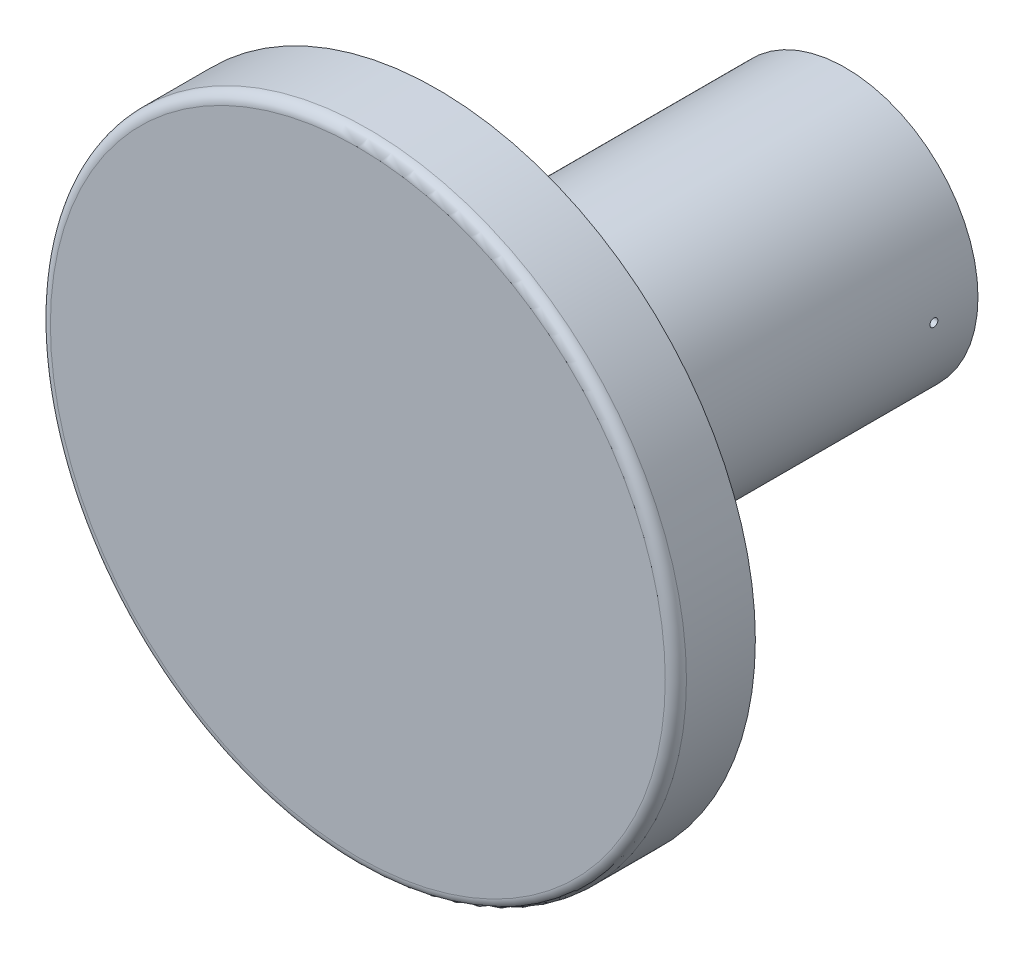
from build123d import *

# Parameters (mm, degrees)
CROQUIS2_R                   = 2.5
SALIENTE_EXTRUIR1_DEPTH      = 7.5
CROQUIS3_R                   = 2.5
SALIENTE_EXTRUIR2_DEPTH      = 0.2
CROQUIS4_R                   = 6
SALIENTE_EXTRUIR3_DEPTH      = 1.5
CROQUIS6_R                   = 5.7
CROQUIS6_R_2                 = 2.5
CORTAR_EXTRUIR1_DEPTH        = 0.2
SALIENTE_EXTRUIR4_DEPTH      = 0.027295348
SALIENTE_EXTRUIR4_DEPTH_BACK = 0.2
CROQUIS6_2_R                 = 5.7
CROQUIS6_2_R_2               = 2.5
REDONDEO1_R                  = 0.2
CROQUIS7_R                   = 0.5
CROQUIS7_R_2                 = 0.2
CORTAR_EXTRUIR2_DEPTH        = 7
CROQUIS8_R                   = 2.12733
CORTAR_EXTRUIR3_DEPTH        = 7
CORTAR_EXTRUIR4_DEPTH        = 7
CORTAR_EXTRUIR4_DEPTH_BACK   = 7
CROQUIS10_R                  = 0.075


with BuildPart() as part:
    # Croquis2 → Saliente-Extruir1 (new body)
    with BuildSketch(Plane.XY):
        Circle(CROQUIS2_R)
    extrude(amount=SALIENTE_EXTRUIR1_DEPTH)

    # Croquis7 → Cortar-Extruir2 (cut)
    with BuildSketch(Plane(origin=(0, 0, 0), x_dir=(-1, 0, 0), z_dir=(0, 0, -1))):
        Circle(CROQUIS7_R)
        with Locations((1.239430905, 0)):
            Circle(CROQUIS7_R_2)
        with Locations(Location((-1.239430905, 0, 0), (0, 0, 180))):
            Circle(CROQUIS7_R_2)
    extrude(amount=-CORTAR_EXTRUIR2_DEPTH, mode=Mode.SUBTRACT)

    # Croquis8 → Cortar-Extruir3 (cut)
    with BuildSketch(Plane(origin=(0, 0, 0.1), x_dir=(-1, 0, 0), z_dir=(0, 0, -1))):
        Circle(CROQUIS8_R)
    extrude(amount=-CORTAR_EXTRUIR3_DEPTH, mode=Mode.SUBTRACT)

    # Croquis10 → Cortar-Extruir4 (cut, two sides: drawn at the far end of the back side and taken through both)
    with BuildSketch(Plane(origin=(0, 0, 0), x_dir=(0, 0, -1), z_dir=(1, 0, 0)).offset(-CORTAR_EXTRUIR4_DEPTH_BACK)):
        with Locations(Location((-0.832063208, 0, 0), (0, 0, 180))):
            Circle(CROQUIS10_R)
    extrude(amount=CORTAR_EXTRUIR4_DEPTH + CORTAR_EXTRUIR4_DEPTH_BACK, mode=Mode.SUBTRACT)


with BuildPart() as body_2:
    # Croquis3 → Saliente-Extruir2 (new body)
    with BuildSketch(Plane.XY.offset(7.5)):
        Circle(CROQUIS3_R)
    extrude(amount=SALIENTE_EXTRUIR2_DEPTH)

    # Croquis4 → Saliente-Extruir3 (add)
    with BuildSketch(Plane.XY.offset(7.7)):
        Circle(CROQUIS4_R)
    extrude(amount=SALIENTE_EXTRUIR3_DEPTH)

    # Croquis6 → Cortar-Extruir1 (cut)
    with BuildSketch(Plane(origin=(0, 0, 7.7), x_dir=(-1, 0, 0), z_dir=(0, 0, -1))):
        Circle(CROQUIS6_R)
        with Locations(Location((0, 0, 0), (0, 0, 180))):
            Circle(CROQUIS6_R_2, mode=Mode.SUBTRACT)
    extrude(amount=-CORTAR_EXTRUIR1_DEPTH, mode=Mode.SUBTRACT)

    # Redondeo1
    redondeo1_edges = [body_2.edges().sort_by_distance(p)[0] for p in [
        (-6, 0, 9.2),
    ]]
    fillet(redondeo1_edges, radius=REDONDEO1_R)


with BuildPart() as body_3:
    # Croquis6_2 → Saliente-Extruir4 (new, two sides: drawn at the far end of the back side and taken through both)
    with BuildSketch(Plane(origin=(0, 0, 7.7), x_dir=(-1, 0, 0), z_dir=(0, 0, -1)).offset(-SALIENTE_EXTRUIR4_DEPTH_BACK)):
        Circle(CROQUIS6_2_R)
        with Locations(Location((0, 0, 0), (0, 0, 180))):
            Circle(CROQUIS6_2_R_2, mode=Mode.SUBTRACT)
    extrude(amount=SALIENTE_EXTRUIR4_DEPTH + SALIENTE_EXTRUIR4_DEPTH_BACK)


with BuildPart() as body_3_1:
    # S_lido-Mover_Copiar1: moved
    add(body_3.part.moved(Location((0, 6, 0))))


with BuildPart() as body_2_1:
    # S_lido-Mover_Copiar1: moved
    add(body_2.part.moved(Location((0, 6, 0))))


with BuildPart() as part_1:
    # S_lido-Mover_Copiar1: moved
    add(part.part.moved(Location((0, 6, 0))))


solid = Compound([body_3_1.part, body_2_1.part, part_1.part])
